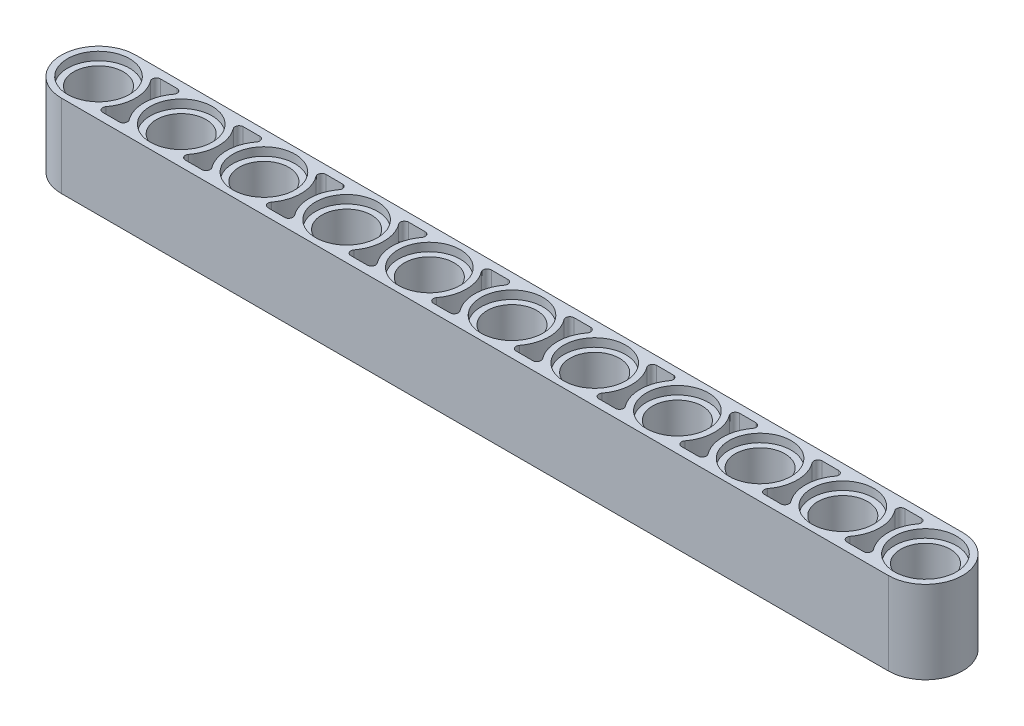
from build123d import *

# Parameters (mm, degrees)
SKETCH1_R           = 2.4
BOSS_EXTRUDE1_DEPTH = 8
SKETCH2_R           = 3
CUT_EXTRUDE1_DEPTH  = 0.8
CUT_EXTRUDE2_START  = -3.2
CUT_EXTRUDE2_DEPTH  = 3.2
CUT_EXTRUDE3_START  = -8
CUT_EXTRUDE3_DEPTH  = 8
CUT_EXTRUDE4_START  = -8
CUT_EXTRUDE4_DEPTH  = 8


with BuildPart() as part:
    # Sketch1 → Boss-Extrude1 (new body)
    with BuildSketch(Plane(origin=(0, 0, 0), x_dir=(1, 0, 0), z_dir=(0, 1, 0))):
        with BuildLine():
            Line((0, -3.6), (112, -3.6))
            ThreePointArc((112, -3.6), (115.6, 0), (112, 3.6))
            Line((112, 3.6), (0, 3.6))
            ThreePointArc((0, 3.6), (-3.6, 0), (0, -3.6))
        make_face()
        with Locations(Location((0, 0, 0), (0, 0, 270))):
            Circle(SKETCH1_R, mode=Mode.SUBTRACT)
        with Locations(Location((8, 0, 0), (0, 0, 270))):
            Circle(SKETCH1_R, mode=Mode.SUBTRACT)
        with Locations(Location((16, 0, 0), (0, 0, 270))):
            Circle(SKETCH1_R, mode=Mode.SUBTRACT)
        with Locations(Location((24, 0, 0), (0, 0, 270))):
            Circle(SKETCH1_R, mode=Mode.SUBTRACT)
        with Locations(Location((32, 0, 0), (0, 0, 270))):
            Circle(SKETCH1_R, mode=Mode.SUBTRACT)
        with Locations(Location((40, 0, 0), (0, 0, 270))):
            Circle(SKETCH1_R, mode=Mode.SUBTRACT)
        with Locations(Location((48, 0, 0), (0, 0, 270))):
            Circle(SKETCH1_R, mode=Mode.SUBTRACT)
        with Locations(Location((56, 0, 0), (0, 0, 270))):
            Circle(SKETCH1_R, mode=Mode.SUBTRACT)
        with Locations(Location((64, 0, 0), (0, 0, 270))):
            Circle(SKETCH1_R, mode=Mode.SUBTRACT)
        with Locations(Location((72, 0, 0), (0, 0, 270))):
            Circle(SKETCH1_R, mode=Mode.SUBTRACT)
        with Locations(Location((80, 0, 0), (0, 0, 270))):
            Circle(SKETCH1_R, mode=Mode.SUBTRACT)
        with Locations(Location((88, 0, 0), (0, 0, 270))):
            Circle(SKETCH1_R, mode=Mode.SUBTRACT)
        with Locations(Location((96, 0, 0), (0, 0, 270))):
            Circle(SKETCH1_R, mode=Mode.SUBTRACT)
        with Locations(Location((104, 0, 0), (0, 0, 270))):
            Circle(SKETCH1_R, mode=Mode.SUBTRACT)
        with Locations(Location((112, 0, 0), (0, 0, 270))):
            Circle(SKETCH1_R, mode=Mode.SUBTRACT)
    extrude(amount=BOSS_EXTRUDE1_DEPTH)

    # Sketch2 → Cut-Extrude1 (cut)
    with BuildSketch(Plane(origin=(0, 8, 0), x_dir=(1, 0, 0), z_dir=(0, 1, 0))):
        with Locations(Location((0, 0, 0), (0, 0, 270))):
            Circle(SKETCH2_R)
        with Locations(Location((8, 0, 0), (0, 0, 270))):
            Circle(SKETCH2_R)
        with Locations(Location((16, 0, 0), (0, 0, 270))):
            Circle(SKETCH2_R)
        with Locations(Location((24, 0, 0), (0, 0, 270))):
            Circle(SKETCH2_R)
        with Locations(Location((32, 0, 0), (0, 0, 270))):
            Circle(SKETCH2_R)
        with Locations(Location((40, 0, 0), (0, 0, 270))):
            Circle(SKETCH2_R)
        with Locations(Location((48, 0, 0), (0, 0, 270))):
            Circle(SKETCH2_R)
        with Locations(Location((56, 0, 0), (0, 0, 270))):
            Circle(SKETCH2_R)
        with Locations(Location((64, 0, 0), (0, 0, 270))):
            Circle(SKETCH2_R)
        with Locations(Location((72, 0, 0), (0, 0, 270))):
            Circle(SKETCH2_R)
        with Locations(Location((80, 0, 0), (0, 0, 270))):
            Circle(SKETCH2_R)
        with Locations(Location((88, 0, 0), (0, 0, 270))):
            Circle(SKETCH2_R)
        with Locations(Location((96, 0, 0), (0, 0, 270))):
            Circle(SKETCH2_R)
        with Locations(Location((104, 0, 0), (0, 0, 270))):
            Circle(SKETCH2_R)
        with Locations(Location((112, 0, 0), (0, 0, 270))):
            Circle(SKETCH2_R)
    cut_extrude1 = extrude(amount=-CUT_EXTRUDE1_DEPTH, mode=Mode.SUBTRACT)

    # Sketch3 → Cut-Extrude2 (cut)
    with BuildSketch(Plane(origin=(0, 8, 0), x_dir=(1, 0, 0), z_dir=(0, 1, 0)).offset(CUT_EXTRUDE2_START)):
        with BuildLine():
            Line((3.2, 2.8), (4.8, 2.8))
            ThreePointArc((4.8, 2.8), (5.157770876, 2.578885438), (5.12, 2.16))
            ThreePointArc((5.12, 2.16), (4.4, 0), (5.12, -2.16))
            ThreePointArc((5.12, -2.16), (5.157770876, -2.578885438), (4.8, -2.8))
            Line((4.8, -2.8), (3.2, -2.8))
            ThreePointArc((3.2, -2.8), (2.842229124, -2.578885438), (2.88, -2.16))
            ThreePointArc((2.88, -2.16), (3.6, 0), (2.88, 2.16))
            ThreePointArc((2.88, 2.16), (2.842229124, 2.578885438), (3.2, 2.8))
        make_face()
        with BuildLine():
            Line((11.2, 2.8), (12.8, 2.8))
            ThreePointArc((12.8, 2.8), (13.157770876, 2.578885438), (13.12, 2.16))
            ThreePointArc((13.12, 2.16), (12.4, 0), (13.12, -2.16))
            ThreePointArc((13.12, -2.16), (13.157770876, -2.578885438), (12.8, -2.8))
            Line((12.8, -2.8), (11.2, -2.8))
            ThreePointArc((11.2, -2.8), (10.842229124, -2.578885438), (10.88, -2.16))
            ThreePointArc((10.88, -2.16), (11.6, 0), (10.88, 2.16))
            ThreePointArc((10.88, 2.16), (10.842229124, 2.578885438), (11.2, 2.8))
        make_face()
        with BuildLine():
            Line((19.2, 2.8), (20.8, 2.8))
            ThreePointArc((20.8, 2.8), (21.157770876, 2.578885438), (21.12, 2.16))
            ThreePointArc((21.12, 2.16), (20.4, 0), (21.12, -2.16))
            ThreePointArc((21.12, -2.16), (21.157770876, -2.578885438), (20.8, -2.8))
            Line((20.8, -2.8), (19.2, -2.8))
            ThreePointArc((19.2, -2.8), (18.842229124, -2.578885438), (18.88, -2.16))
            ThreePointArc((18.88, -2.16), (19.6, 0), (18.88, 2.16))
            ThreePointArc((18.88, 2.16), (18.842229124, 2.578885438), (19.2, 2.8))
        make_face()
        with BuildLine():
            Line((27.2, 2.8), (28.8, 2.8))
            ThreePointArc((28.8, 2.8), (29.157770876, 2.578885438), (29.12, 2.16))
            ThreePointArc((29.12, 2.16), (28.4, 0), (29.12, -2.16))
            ThreePointArc((29.12, -2.16), (29.157770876, -2.578885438), (28.8, -2.8))
            Line((28.8, -2.8), (27.2, -2.8))
            ThreePointArc((27.2, -2.8), (26.842229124, -2.578885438), (26.88, -2.16))
            ThreePointArc((26.88, -2.16), (27.6, 0), (26.88, 2.16))
            ThreePointArc((26.88, 2.16), (26.842229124, 2.578885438), (27.2, 2.8))
        make_face()
        with BuildLine():
            Line((35.2, 2.8), (36.8, 2.8))
            ThreePointArc((36.8, 2.8), (37.157770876, 2.578885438), (37.12, 2.16))
            ThreePointArc((37.12, 2.16), (36.4, 0), (37.12, -2.16))
            ThreePointArc((37.12, -2.16), (37.157770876, -2.578885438), (36.8, -2.8))
            Line((36.8, -2.8), (35.2, -2.8))
            ThreePointArc((35.2, -2.8), (34.842229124, -2.578885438), (34.88, -2.16))
            ThreePointArc((34.88, -2.16), (35.6, 0), (34.88, 2.16))
            ThreePointArc((34.88, 2.16), (34.842229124, 2.578885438), (35.2, 2.8))
        make_face()
        with BuildLine():
            Line((43.2, 2.8), (44.8, 2.8))
            ThreePointArc((44.8, 2.8), (45.157770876, 2.578885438), (45.12, 2.16))
            ThreePointArc((45.12, 2.16), (44.4, 0), (45.12, -2.16))
            ThreePointArc((45.12, -2.16), (45.157770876, -2.578885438), (44.8, -2.8))
            Line((44.8, -2.8), (43.2, -2.8))
            ThreePointArc((43.2, -2.8), (42.842229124, -2.578885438), (42.88, -2.16))
            ThreePointArc((42.88, -2.16), (43.6, 0), (42.88, 2.16))
            ThreePointArc((42.88, 2.16), (42.842229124, 2.578885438), (43.2, 2.8))
        make_face()
        with BuildLine():
            Line((51.2, 2.8), (52.8, 2.8))
            ThreePointArc((52.8, 2.8), (53.157770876, 2.578885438), (53.12, 2.16))
            ThreePointArc((53.12, 2.16), (52.4, 0), (53.12, -2.16))
            ThreePointArc((53.12, -2.16), (53.157770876, -2.578885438), (52.8, -2.8))
            Line((52.8, -2.8), (51.2, -2.8))
            ThreePointArc((51.2, -2.8), (50.842229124, -2.578885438), (50.88, -2.16))
            ThreePointArc((50.88, -2.16), (51.6, 0), (50.88, 2.16))
            ThreePointArc((50.88, 2.16), (50.842229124, 2.578885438), (51.2, 2.8))
        make_face()
        with BuildLine():
            Line((59.2, 2.8), (60.8, 2.8))
            ThreePointArc((60.8, 2.8), (61.157770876, 2.578885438), (61.12, 2.16))
            ThreePointArc((61.12, 2.16), (60.4, 0), (61.12, -2.16))
            ThreePointArc((61.12, -2.16), (61.157770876, -2.578885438), (60.8, -2.8))
            Line((60.8, -2.8), (59.2, -2.8))
            ThreePointArc((59.2, -2.8), (58.842229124, -2.578885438), (58.88, -2.16))
            ThreePointArc((58.88, -2.16), (59.6, 0), (58.88, 2.16))
            ThreePointArc((58.88, 2.16), (58.842229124, 2.578885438), (59.2, 2.8))
        make_face()
        with BuildLine():
            Line((67.2, 2.8), (68.8, 2.8))
            ThreePointArc((68.8, 2.8), (69.157770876, 2.578885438), (69.12, 2.16))
            ThreePointArc((69.12, 2.16), (68.4, 0), (69.12, -2.16))
            ThreePointArc((69.12, -2.16), (69.157770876, -2.578885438), (68.8, -2.8))
            Line((68.8, -2.8), (67.2, -2.8))
            ThreePointArc((67.2, -2.8), (66.842229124, -2.578885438), (66.88, -2.16))
            ThreePointArc((66.88, -2.16), (67.6, 0), (66.88, 2.16))
            ThreePointArc((66.88, 2.16), (66.842229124, 2.578885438), (67.2, 2.8))
        make_face()
        with BuildLine():
            Line((75.2, 2.8), (76.8, 2.8))
            ThreePointArc((76.8, 2.8), (77.157770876, 2.578885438), (77.12, 2.16))
            ThreePointArc((77.12, 2.16), (76.4, 0), (77.12, -2.16))
            ThreePointArc((77.12, -2.16), (77.157770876, -2.578885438), (76.8, -2.8))
            Line((76.8, -2.8), (75.2, -2.8))
            ThreePointArc((75.2, -2.8), (74.842229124, -2.578885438), (74.88, -2.16))
            ThreePointArc((74.88, -2.16), (75.6, 0), (74.88, 2.16))
            ThreePointArc((74.88, 2.16), (74.842229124, 2.578885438), (75.2, 2.8))
        make_face()
        with BuildLine():
            Line((83.2, 2.8), (84.8, 2.8))
            ThreePointArc((84.8, 2.8), (85.157770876, 2.578885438), (85.12, 2.16))
            ThreePointArc((85.12, 2.16), (84.4, 0), (85.12, -2.16))
            ThreePointArc((85.12, -2.16), (85.157770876, -2.578885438), (84.8, -2.8))
            Line((84.8, -2.8), (83.2, -2.8))
            ThreePointArc((83.2, -2.8), (82.842229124, -2.578885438), (82.88, -2.16))
            ThreePointArc((82.88, -2.16), (83.6, 0), (82.88, 2.16))
            ThreePointArc((82.88, 2.16), (82.842229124, 2.578885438), (83.2, 2.8))
        make_face()
        with BuildLine():
            Line((91.2, 2.8), (92.8, 2.8))
            ThreePointArc((92.8, 2.8), (93.157770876, 2.578885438), (93.12, 2.16))
            ThreePointArc((93.12, 2.16), (92.4, 0), (93.12, -2.16))
            ThreePointArc((93.12, -2.16), (93.157770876, -2.578885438), (92.8, -2.8))
            Line((92.8, -2.8), (91.2, -2.8))
            ThreePointArc((91.2, -2.8), (90.842229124, -2.578885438), (90.88, -2.16))
            ThreePointArc((90.88, -2.16), (91.6, 0), (90.88, 2.16))
            ThreePointArc((90.88, 2.16), (90.842229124, 2.578885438), (91.2, 2.8))
        make_face()
        with BuildLine():
            Line((99.2, 2.8), (100.8, 2.8))
            ThreePointArc((100.8, 2.8), (101.157770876, 2.578885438), (101.12, 2.16))
            ThreePointArc((101.12, 2.16), (100.4, 0), (101.12, -2.16))
            ThreePointArc((101.12, -2.16), (101.157770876, -2.578885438), (100.8, -2.8))
            Line((100.8, -2.8), (99.2, -2.8))
            ThreePointArc((99.2, -2.8), (98.842229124, -2.578885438), (98.88, -2.16))
            ThreePointArc((98.88, -2.16), (99.6, 0), (98.88, 2.16))
            ThreePointArc((98.88, 2.16), (98.842229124, 2.578885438), (99.2, 2.8))
        make_face()
        with BuildLine():
            Line((107.2, 2.8), (108.8, 2.8))
            ThreePointArc((108.8, 2.8), (109.157770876, 2.578885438), (109.12, 2.16))
            ThreePointArc((109.12, 2.16), (108.4, 0), (109.12, -2.16))
            ThreePointArc((109.12, -2.16), (109.157770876, -2.578885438), (108.8, -2.8))
            Line((108.8, -2.8), (107.2, -2.8))
            ThreePointArc((107.2, -2.8), (106.842229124, -2.578885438), (106.88, -2.16))
            ThreePointArc((106.88, -2.16), (107.6, 0), (106.88, 2.16))
            ThreePointArc((106.88, 2.16), (106.842229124, 2.578885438), (107.2, 2.8))
        make_face()
    cut_extrude2 = extrude(amount=CUT_EXTRUDE2_DEPTH, mode=Mode.SUBTRACT)

    # Mirror1: Cut-Extrude1, Cut-Extrude2 across plane
    add(cut_extrude1.mirror(Plane.ZX.offset(4)), mode=Mode.SUBTRACT)
    add(cut_extrude2.mirror(Plane.ZX.offset(4)), mode=Mode.SUBTRACT)

    # Sketch4 → Cut-Extrude3 (cut)
    with BuildSketch(Plane(origin=(0, 8, 0), x_dir=(1, 0, 0), z_dir=(0, 1, 0)).offset(CUT_EXTRUDE3_START)):
        with BuildLine():
            Line((96, 3.6), (112, 3.6))
            ThreePointArc((112, 3.6), (115.6, 0), (112, -3.6))
            Line((112, -3.6), (96, -3.6))
            ThreePointArc((96, -3.6), (99.6, 0), (96, 3.6))
        make_face()
    extrude(amount=CUT_EXTRUDE3_DEPTH, mode=Mode.SUBTRACT)

    # Sketch5 → Cut-Extrude4 (cut)
    with BuildSketch(Plane(origin=(0, 8, 0), x_dir=(1, 0, 0), z_dir=(0, 1, 0)).offset(CUT_EXTRUDE4_START)):
        with BuildLine():
            Line((80, 3.6), (96, 3.6))
            ThreePointArc((96, 3.6), (99.6, 0), (96, -3.6))
            Line((96, -3.6), (80, -3.6))
            ThreePointArc((80, -3.6), (83.6, 0), (80, 3.6))
        make_face()
    extrude(amount=CUT_EXTRUDE4_DEPTH, mode=Mode.SUBTRACT)


solid = part.part
